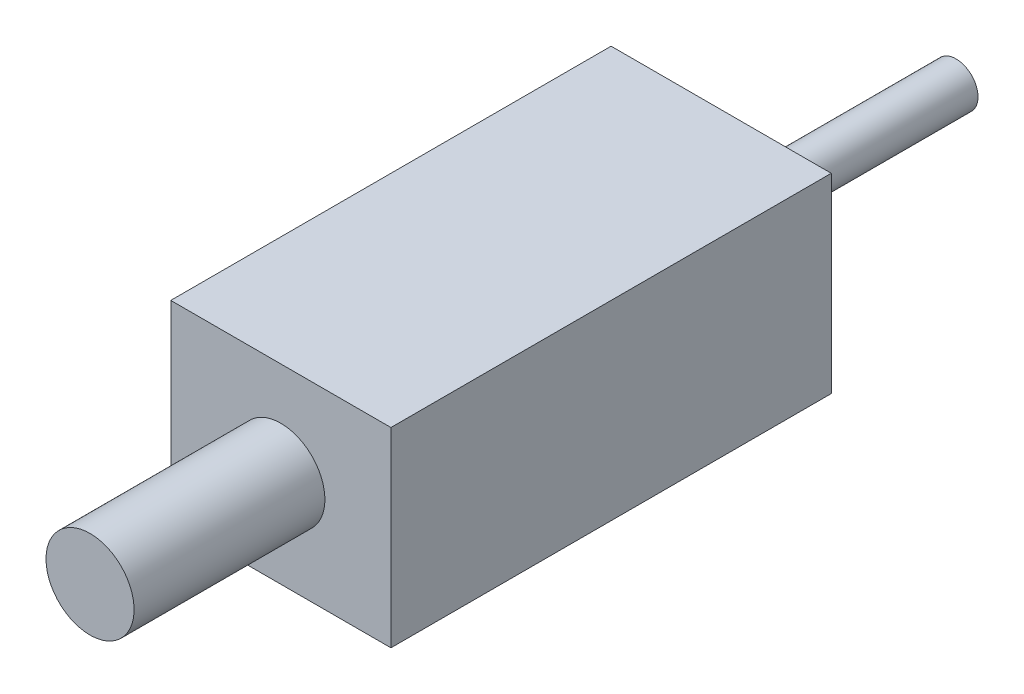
from build123d import *

# Parameters (mm, degrees)
SKETCH1_W           = 15
SKETCH1_H           = 13
BOSS_EXTRUDE1_DEPTH = 30
SKETCH2_R           = 1.5
BOSS_EXTRUDE2_DEPTH = 16
SKETCH3_R           = 3
BOSS_EXTRUDE3_DEPTH = 13


with BuildPart() as part:
    # Sketch1 → Boss-Extrude1 (new body)
    with BuildSketch(Plane.XY):
        Rectangle(SKETCH1_W, SKETCH1_H)
    extrude(amount=BOSS_EXTRUDE1_DEPTH)

    # Sketch2 → Boss-Extrude2 (add)
    with BuildSketch(Plane(origin=(0, 0, 0), x_dir=(-1, 0, 0), z_dir=(0, 0, -1))):
        Circle(SKETCH2_R)
    extrude(amount=BOSS_EXTRUDE2_DEPTH)

    # Sketch3 → Boss-Extrude3 (add)
    with BuildSketch(Plane.XY.offset(30)):
        with Locations(Location((0, 0, 0), (0, 0, 180))):
            Circle(SKETCH3_R)
    extrude(amount=BOSS_EXTRUDE3_DEPTH)


solid = part.part
